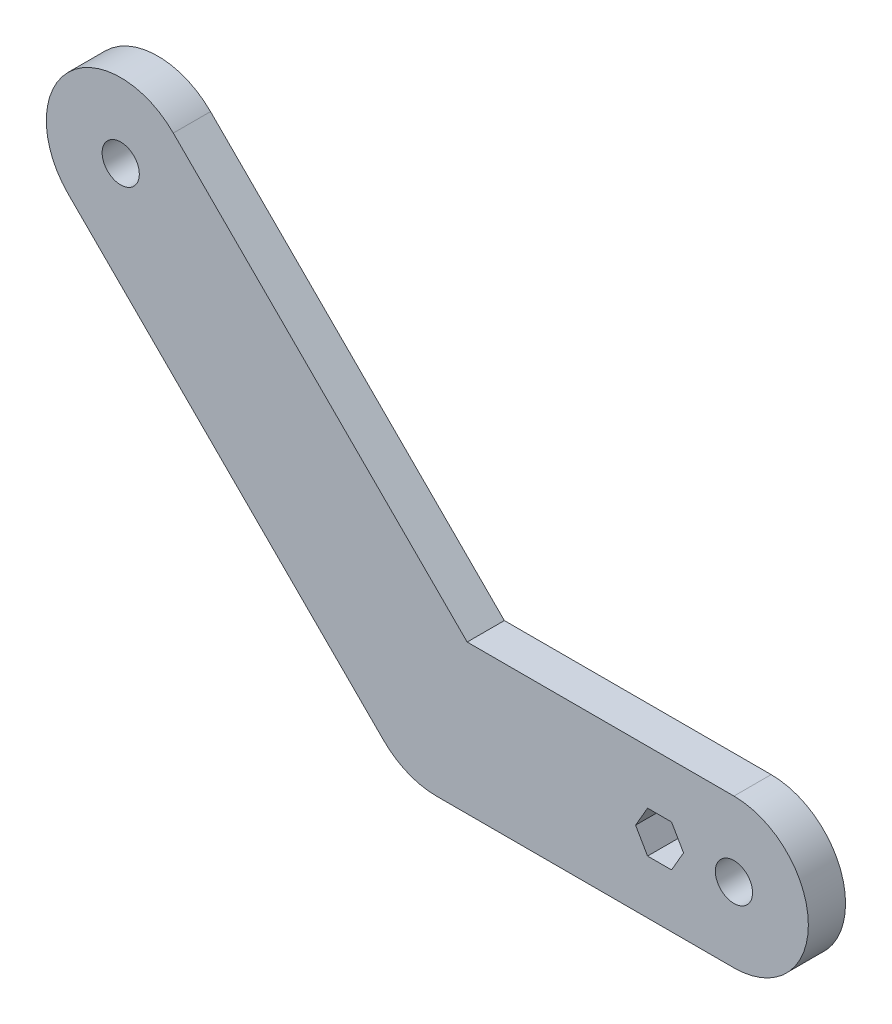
from build123d import *

# Parameters (mm, degrees)
SKETCH3_R           = 1.5875
BOSS_EXTRUDE2_DEPTH = 3.175
SKETCH4_R           = 1.5875
BOSS_EXTRUDE3_DEPTH = 3.175


with BuildPart() as part:
    # Sketch3 → Boss-Extrude2 (new body)
    with BuildSketch(Plane.XY):
        with BuildLine():
            Line((0, 6.35), (25.4, 6.35))
            ThreePointArc((25.4, 6.35), (31.75, 0), (25.4, -6.35))
            Line((25.4, -6.35), (0, -6.35))
            ThreePointArc((0, -6.35), (-6.35, 0), (0, 6.35))
        make_face()
        with Locations((25.4, 0)):
            Circle(SKETCH3_R, mode=Mode.SUBTRACT)
        Polygon((18.026894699, 1.772070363), (17.003789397, 0), (18.026894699, -1.772070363), (20.073105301, -1.772070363), (21.096210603, 0), (20.073105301, 1.772070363), align=None, mode=Mode.SUBTRACT)
    extrude(amount=BOSS_EXTRUDE2_DEPTH)

    # Sketch4 → Boss-Extrude3 (add)
    with BuildSketch(Plane.XY):
        with BuildLine():
            Line((-4.490128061, -4.490128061), (-31.430896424, 22.450640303))
            ThreePointArc((-31.430896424, 22.450640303), (-31.430896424, 31.430896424), (-22.450640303, 31.430896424))
            Line((-22.450640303, 31.430896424), (4.490128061, 4.490128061))
            ThreePointArc((4.490128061, 4.490128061), (4.490128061, -4.490128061), (-4.490128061, -4.490128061))
        make_face()
        with Locations((-26.940768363, 26.940768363)):
            Circle(SKETCH4_R, mode=Mode.SUBTRACT)
    extrude(amount=BOSS_EXTRUDE3_DEPTH)


solid = part.part
